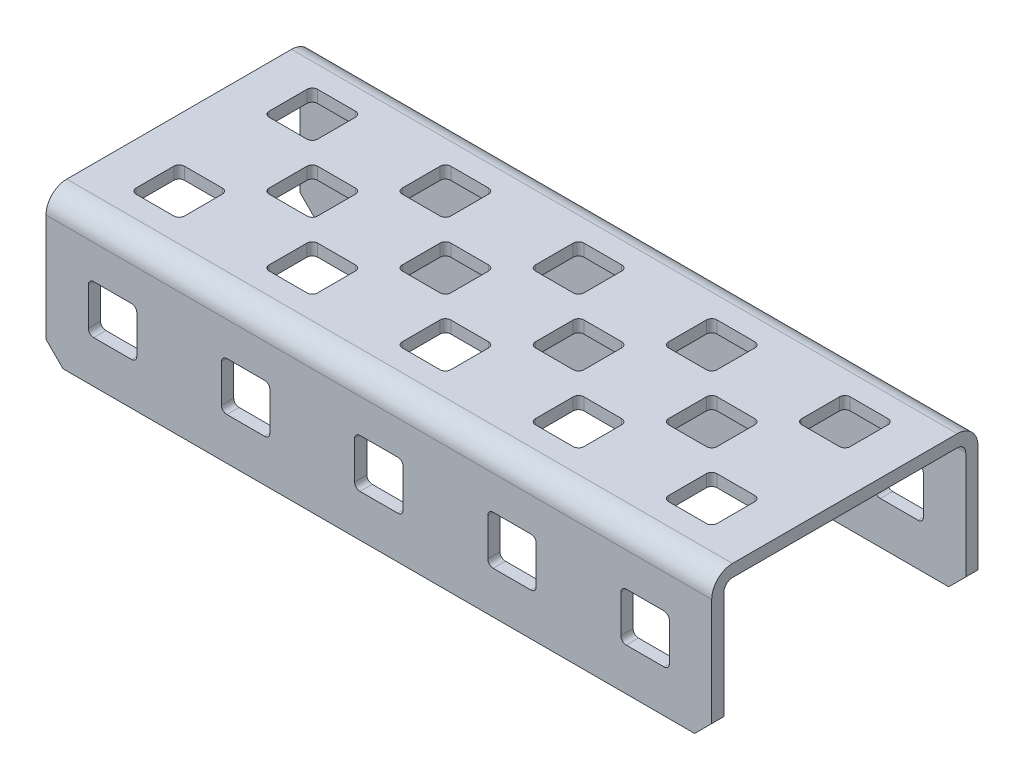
from build123d import *

# Parameters (mm, degrees)
SKETCH1_W           = 63.5
SKETCH1_H           = 25.4
BOSS_EXTRUDE1_DEPTH = 13.8684
SKETCH2_W           = 23.0632
SKETCH2_H           = 12.7
CUT_EXTRUDE1_DEPTH  = 67.610188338
SKETCH3_W           = 4.6228
SKETCH3_H           = 4.6228
CUT_EXTRUDE2_DEPTH  = 43.145487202
SKETCH4_W           = 4.6228
SKETCH4_H           = 4.6228
CUT_EXTRUDE3_DEPTH  = 43.145487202
SKETCH5_W           = 4.6228
SKETCH5_H           = 4.6228
CUT_EXTRUDE4_DEPTH  = 43.145487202
SKETCH6_W           = 4.6228
SKETCH6_H           = 4.6228
CUT_EXTRUDE5_DEPTH  = 43.145487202
SKETCH7_W           = 4.6228
SKETCH7_H           = 4.6228
CUT_EXTRUDE6_DEPTH  = 43.145487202
SKETCH8_W           = 4.6228
SKETCH8_H           = 4.6228
CUT_EXTRUDE7_DEPTH  = 43.145487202
SKETCH9_W           = 4.6228
SKETCH9_H           = 4.6228
CUT_EXTRUDE8_DEPTH  = 43.145487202
SKETCH10_W          = 4.6228
SKETCH10_H          = 4.6228
CUT_EXTRUDE9_DEPTH  = 43.145487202
SKETCH11_W          = 4.6228
SKETCH11_H          = 4.6228
CUT_EXTRUDE10_DEPTH = 43.145487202
SKETCH12_W          = 4.6228
SKETCH12_H          = 4.6228
CUT_EXTRUDE11_DEPTH = 43.145487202
SKETCH13_W          = 4.6228
SKETCH13_H          = 4.6228
CUT_EXTRUDE12_DEPTH = 43.145487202
SKETCH14_W          = 4.6228
SKETCH14_H          = 4.6228
CUT_EXTRUDE13_DEPTH = 43.145487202
SKETCH15_W          = 4.6228
SKETCH15_H          = 4.6228
CUT_EXTRUDE14_DEPTH = 43.145487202
CUT_EXTRUDE15_REACH = 48.669
SKETCH16_W          = 4.6228
SKETCH16_H          = 4.6228
CUT_EXTRUDE16_REACH = 48.669
SKETCH17_W          = 4.6228
SKETCH17_H          = 4.6228
CUT_EXTRUDE17_REACH = 48.669
SKETCH18_W          = 4.6228
SKETCH18_H          = 4.6228
CUT_EXTRUDE18_REACH = 48.669
SKETCH19_W          = 4.6228
SKETCH19_H          = 4.6228
CUT_EXTRUDE19_REACH = 48.669
SKETCH20_W          = 4.6228
SKETCH20_H          = 4.6228
SKETCH21_W          = 4.6228
SKETCH21_H          = 4.6228
CUT_EXTRUDE20_DEPTH = 47.669314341
SKETCH22_W          = 4.6228
SKETCH22_H          = 4.6228
CUT_EXTRUDE21_DEPTH = 47.669314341
SKETCH23_W          = 4.6228
SKETCH23_H          = 4.6228
CUT_EXTRUDE22_DEPTH = 47.669314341
SKETCH24_W          = 4.6228
SKETCH24_H          = 4.6228
CUT_EXTRUDE23_DEPTH = 47.669314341
SKETCH25_W          = 4.6228
SKETCH25_H          = 4.6228
CUT_EXTRUDE24_DEPTH = 47.669314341
SKETCH26_W          = 4.6228
SKETCH26_H          = 4.6228
CUT_EXTRUDE25_DEPTH = 43.51217014
CHAMFER1_SIZE       = 1.6256
FILLET1_R           = 0.508
FILLET2_R           = 0.812800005
FILLET3_R           = 1.981200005


with BuildPart() as part:
    # Sketch1 → Boss-Extrude1 (new body)
    with BuildSketch(Plane.XZ.offset(12.7)):
        with Locations((5.284779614, -2.900550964)):
            Rectangle(SKETCH1_W, SKETCH1_H)
    extrude(amount=-BOSS_EXTRUDE1_DEPTH)

    # Sketch2 → Cut-Extrude1 (cut, through all)
    with BuildSketch(Plane(origin=(37.034779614, 0, 0), x_dir=(0, 0, -1), z_dir=(1, 0, 0))):
        with Locations((2.900550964, -6.35)):
            Rectangle(SKETCH2_W, SKETCH2_H)
    extrude(amount=-CUT_EXTRUDE1_DEPTH, mode=Mode.SUBTRACT)

    # Sketch3 → Cut-Extrude2 (cut, through all)
    with BuildSketch(Plane.XZ):
        with Locations((24.334779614, -2.900550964)):
            Rectangle(SKETCH3_W, SKETCH3_H)
    extrude(amount=-CUT_EXTRUDE2_DEPTH, mode=Mode.SUBTRACT)

    # Sketch4 → Cut-Extrude3 (cut, through all)
    with BuildSketch(Plane.XZ):
        with Locations((11.634779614, -2.900550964)):
            Rectangle(SKETCH4_W, SKETCH4_H)
    extrude(amount=-CUT_EXTRUDE3_DEPTH, mode=Mode.SUBTRACT)

    # Sketch5 → Cut-Extrude4 (cut, through all)
    with BuildSketch(Plane.XZ):
        with Locations((-20.115220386, -9.250550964)):
            Rectangle(SKETCH5_W, SKETCH5_H)
    extrude(amount=-CUT_EXTRUDE4_DEPTH, mode=Mode.SUBTRACT)

    # Sketch6 → Cut-Extrude5 (cut, through all)
    with BuildSketch(Plane.XZ):
        with Locations((-20.115220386, 3.449449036)):
            Rectangle(SKETCH6_W, SKETCH6_H)
    extrude(amount=-CUT_EXTRUDE5_DEPTH, mode=Mode.SUBTRACT)

    # Sketch7 → Cut-Extrude6 (cut, through all)
    with BuildSketch(Plane.XZ):
        with Locations((-13.765220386, -2.900550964)):
            Rectangle(SKETCH7_W, SKETCH7_H)
    extrude(amount=-CUT_EXTRUDE6_DEPTH, mode=Mode.SUBTRACT)

    # Sketch8 → Cut-Extrude7 (cut, through all)
    with BuildSketch(Plane.XZ):
        with Locations((-7.415220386, -9.250550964)):
            Rectangle(SKETCH8_W, SKETCH8_H)
    extrude(amount=-CUT_EXTRUDE7_DEPTH, mode=Mode.SUBTRACT)

    # Sketch9 → Cut-Extrude8 (cut, through all)
    with BuildSketch(Plane.XZ):
        with Locations((-7.415220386, 3.449449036)):
            Rectangle(SKETCH9_W, SKETCH9_H)
    extrude(amount=-CUT_EXTRUDE8_DEPTH, mode=Mode.SUBTRACT)

    # Sketch10 → Cut-Extrude9 (cut, through all)
    with BuildSketch(Plane.XZ):
        with Locations((5.284779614, -9.250550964)):
            Rectangle(SKETCH10_W, SKETCH10_H)
    extrude(amount=-CUT_EXTRUDE9_DEPTH, mode=Mode.SUBTRACT)

    # Sketch11 → Cut-Extrude10 (cut, through all)
    with BuildSketch(Plane.XZ):
        with Locations((5.284779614, 3.449449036)):
            Rectangle(SKETCH11_W, SKETCH11_H)
    extrude(amount=-CUT_EXTRUDE10_DEPTH, mode=Mode.SUBTRACT)

    # Sketch12 → Cut-Extrude11 (cut, through all)
    with BuildSketch(Plane.XZ):
        with Locations((17.984779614, -9.250550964)):
            Rectangle(SKETCH12_W, SKETCH12_H)
    extrude(amount=-CUT_EXTRUDE11_DEPTH, mode=Mode.SUBTRACT)

    # Sketch13 → Cut-Extrude12 (cut, through all)
    with BuildSketch(Plane.XZ):
        with Locations((17.984779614, 3.449449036)):
            Rectangle(SKETCH13_W, SKETCH13_H)
    extrude(amount=-CUT_EXTRUDE12_DEPTH, mode=Mode.SUBTRACT)

    # Sketch14 → Cut-Extrude13 (cut, through all)
    with BuildSketch(Plane.XZ):
        with Locations((30.684779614, -9.250550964)):
            Rectangle(SKETCH14_W, SKETCH14_H)
    extrude(amount=-CUT_EXTRUDE13_DEPTH, mode=Mode.SUBTRACT)

    # Sketch15 → Cut-Extrude14 (cut, through all)
    with BuildSketch(Plane.XZ):
        with Locations((30.684779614, 3.449449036)):
            Rectangle(SKETCH15_W, SKETCH15_H)
    extrude(amount=-CUT_EXTRUDE14_DEPTH, mode=Mode.SUBTRACT)

    # Sketch16 → Cut-Extrude15 (cut, up to next)
    with BuildSketch(Plane.XY.offset(9.799449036), mode=Mode.PRIVATE) as cut_extrude15_sk1:
        with Locations((-20.115220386, -6.35)):
            Rectangle(SKETCH16_W, SKETCH16_H)
    cut_extrude15_tool1 = extrude(cut_extrude15_sk1.sketch, amount=-CUT_EXTRUDE15_REACH, mode=Mode.PRIVATE) & part.part
    add(cut_extrude15_tool1.solids().sort_by_distance((-20.11522, -6.35, 9.799449))[0], mode=Mode.SUBTRACT)

    # Sketch17 → Cut-Extrude16 (cut, up to next)
    with BuildSketch(Plane.XY.offset(9.799449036), mode=Mode.PRIVATE) as cut_extrude16_sk1:
        with Locations((-7.415220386, -6.35)):
            Rectangle(SKETCH17_W, SKETCH17_H)
    cut_extrude16_tool1 = extrude(cut_extrude16_sk1.sketch, amount=-CUT_EXTRUDE16_REACH, mode=Mode.PRIVATE) & part.part
    add(cut_extrude16_tool1.solids().sort_by_distance((-7.41522, -6.35, 9.799449))[0], mode=Mode.SUBTRACT)

    # Sketch18 → Cut-Extrude17 (cut, up to next)
    with BuildSketch(Plane.XY.offset(9.799449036), mode=Mode.PRIVATE) as cut_extrude17_sk1:
        with Locations((5.284779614, -6.35)):
            Rectangle(SKETCH18_W, SKETCH18_H)
    cut_extrude17_tool1 = extrude(cut_extrude17_sk1.sketch, amount=-CUT_EXTRUDE17_REACH, mode=Mode.PRIVATE) & part.part
    add(cut_extrude17_tool1.solids().sort_by_distance((5.28478, -6.35, 9.799449))[0], mode=Mode.SUBTRACT)

    # Sketch19 → Cut-Extrude18 (cut, up to next)
    with BuildSketch(Plane.XY.offset(9.799449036), mode=Mode.PRIVATE) as cut_extrude18_sk1:
        with Locations((17.984779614, -6.35)):
            Rectangle(SKETCH19_W, SKETCH19_H)
    cut_extrude18_tool1 = extrude(cut_extrude18_sk1.sketch, amount=-CUT_EXTRUDE18_REACH, mode=Mode.PRIVATE) & part.part
    add(cut_extrude18_tool1.solids().sort_by_distance((17.98478, -6.35, 9.799449))[0], mode=Mode.SUBTRACT)

    # Sketch20 → Cut-Extrude19 (cut, up to next)
    with BuildSketch(Plane.XY.offset(9.799449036), mode=Mode.PRIVATE) as cut_extrude19_sk1:
        with Locations((30.684779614, -6.35)):
            Rectangle(SKETCH20_W, SKETCH20_H)
    cut_extrude19_tool1 = extrude(cut_extrude19_sk1.sketch, amount=-CUT_EXTRUDE19_REACH, mode=Mode.PRIVATE) & part.part
    add(cut_extrude19_tool1.solids().sort_by_distance((30.68478, -6.35, 9.799449))[0], mode=Mode.SUBTRACT)

    # Sketch21 → Cut-Extrude20 (cut, through all)
    with BuildSketch(Plane(origin=(0, 0, -15.600550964), x_dir=(-1, 0, 0), z_dir=(0, 0, -1))):
        with Locations((20.115220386, -6.35)):
            Rectangle(SKETCH21_W, SKETCH21_H)
    extrude(amount=-CUT_EXTRUDE20_DEPTH, mode=Mode.SUBTRACT)

    # Sketch22 → Cut-Extrude21 (cut, through all)
    with BuildSketch(Plane(origin=(0, 0, -15.600550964), x_dir=(-1, 0, 0), z_dir=(0, 0, -1))):
        with Locations((7.415220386, -6.35)):
            Rectangle(SKETCH22_W, SKETCH22_H)
    extrude(amount=-CUT_EXTRUDE21_DEPTH, mode=Mode.SUBTRACT)

    # Sketch23 → Cut-Extrude22 (cut, through all)
    with BuildSketch(Plane(origin=(0, 0, -15.600550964), x_dir=(-1, 0, 0), z_dir=(0, 0, -1))):
        with Locations((-5.284779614, -6.35)):
            Rectangle(SKETCH23_W, SKETCH23_H)
    extrude(amount=-CUT_EXTRUDE22_DEPTH, mode=Mode.SUBTRACT)

    # Sketch24 → Cut-Extrude23 (cut, through all)
    with BuildSketch(Plane(origin=(0, 0, -15.600550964), x_dir=(-1, 0, 0), z_dir=(0, 0, -1))):
        with Locations((-17.984779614, -6.35)):
            Rectangle(SKETCH24_W, SKETCH24_H)
    extrude(amount=-CUT_EXTRUDE23_DEPTH, mode=Mode.SUBTRACT)

    # Sketch25 → Cut-Extrude24 (cut, through all)
    with BuildSketch(Plane(origin=(0, 0, -15.600550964), x_dir=(-1, 0, 0), z_dir=(0, 0, -1))):
        with Locations((-30.684779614, -6.35)):
            Rectangle(SKETCH25_W, SKETCH25_H)
    extrude(amount=-CUT_EXTRUDE24_DEPTH, mode=Mode.SUBTRACT)

    # Sketch26 → Cut-Extrude25 (cut, through all)
    with BuildSketch(Plane(origin=(0, 1.1684, 0), x_dir=(-1, 0, 0), z_dir=(0, 1, 0))):
        with Locations((1.065220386, -2.900550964)):
            Rectangle(SKETCH26_W, SKETCH26_H)
    extrude(amount=-CUT_EXTRUDE25_DEPTH, mode=Mode.SUBTRACT)

    # Chamfer1
    chamfer1_edges = [part.edges().sort_by_distance(p)[0] for p in [
        (-26.465220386, -12.7, -15.016350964),
        (37.034779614, -12.7, 9.215249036),
        (37.034779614, -12.7, -15.016350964),
        (-26.465220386, -12.7, 9.215249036),
    ]]
    chamfer(chamfer1_edges, length=CHAMFER1_SIZE)

    # Fillet1
    fillet1_edges = [part.edges().sort_by_distance(p)[0] for p in [
        (-5.103820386, 0.5842, -6.939150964),
        (-5.103820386, 0.5842, -11.561950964),
        (-9.726620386, 0.5842, -11.561950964),
        (-9.726620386, 0.5842, -6.939150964),
        (-5.103820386, 0.5842, 5.760849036),
        (-5.103820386, 0.5842, 1.138049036),
        (-9.726620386, 0.5842, 1.138049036),
        (-9.726620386, 0.5842, 5.760849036),
        (7.596179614, 0.5842, -6.939150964),
        (7.596179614, 0.5842, -11.561950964),
        (2.973379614, 0.5842, -11.561950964),
        (2.973379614, 0.5842, -6.939150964),
        (7.596179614, 0.5842, 5.760849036),
        (7.596179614, 0.5842, 1.138049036),
        (2.973379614, 0.5842, 1.138049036),
        (2.973379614, 0.5842, 5.760849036),
        (20.296179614, 0.5842, -6.939150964),
        (20.296179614, 0.5842, -11.561950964),
        (15.673379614, 0.5842, -11.561950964),
        (15.673379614, 0.5842, -6.939150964),
        (20.296179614, 0.5842, 5.760849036),
        (20.296179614, 0.5842, 1.138049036),
        (15.673379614, 0.5842, 1.138049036),
        (15.673379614, 0.5842, 5.760849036),
        (32.996179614, 0.5842, -6.939150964),
        (32.996179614, 0.5842, -11.561950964),
        (28.373379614, 0.5842, -11.561950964),
        (28.373379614, 0.5842, -6.939150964),
        (32.996179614, 0.5842, 5.760849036),
        (32.996179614, 0.5842, 1.138049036),
        (28.373379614, 0.5842, 1.138049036),
        (28.373379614, 0.5842, 5.760849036),
        (-17.803820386, -8.6614, 9.215249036),
        (-22.426620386, -8.6614, 9.215249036),
        (-22.426620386, -4.0386, 9.215249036),
        (-17.803820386, -4.0386, 9.215249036),
        (-5.103820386, -8.6614, 9.215249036),
        (-9.726620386, -8.6614, 9.215249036),
        (-9.726620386, -4.0386, 9.215249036),
        (-5.103820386, -4.0386, 9.215249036),
        (7.596179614, -8.6614, 9.215249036),
        (2.973379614, -8.6614, 9.215249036),
        (2.973379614, -4.0386, 9.215249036),
        (7.596179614, -4.0386, 9.215249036),
        (20.296179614, -8.6614, 9.215249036),
        (15.673379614, -8.6614, 9.215249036),
        (15.673379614, -4.0386, 9.215249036),
        (20.296179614, -4.0386, 9.215249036),
        (32.996179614, -8.6614, 9.215249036),
        (28.373379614, -8.6614, 9.215249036),
        (28.373379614, -4.0386, 9.215249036),
        (32.996179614, -4.0386, 9.215249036),
        (-17.803820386, -8.6614, -15.016350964),
        (-22.426620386, -4.0386, -15.016350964),
        (-17.803820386, -4.0386, -15.016350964),
        (-22.426620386, -8.6614, -15.016350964),
        (22.023379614, 0.5842, -5.211950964),
        (22.023379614, 0.5842, -0.589150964),
        (26.646179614, 0.5842, -0.589150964),
        (26.646179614, 0.5842, -5.211950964),
        (-5.103820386, -8.6614, -15.016350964),
        (-9.726620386, -4.0386, -15.016350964),
        (-5.103820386, -4.0386, -15.016350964),
        (-9.726620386, -8.6614, -15.016350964),
        (7.596179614, -8.6614, -15.016350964),
        (2.973379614, -4.0386, -15.016350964),
        (7.596179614, -4.0386, -15.016350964),
        (2.973379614, -8.6614, -15.016350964),
        (20.296179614, -8.6614, -15.016350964),
        (15.673379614, -4.0386, -15.016350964),
        (20.296179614, -4.0386, -15.016350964),
        (15.673379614, -8.6614, -15.016350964),
        (32.996179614, -8.6614, -15.016350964),
        (28.373379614, -4.0386, -15.016350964),
        (32.996179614, -4.0386, -15.016350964),
        (28.373379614, -8.6614, -15.016350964),
        (1.246179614, 0.5842, -0.589150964),
        (-3.376620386, 0.5842, -0.589150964),
        (-3.376620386, 0.5842, -5.211950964),
        (1.246179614, 0.5842, -5.211950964),
        (9.323379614, 0.5842, -5.211950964),
        (9.323379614, 0.5842, -0.589150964),
        (13.946179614, 0.5842, -0.589150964),
        (13.946179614, 0.5842, -5.211950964),
        (-17.803820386, 0.5842, -6.939150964),
        (-17.803820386, 0.5842, -11.561950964),
        (-22.426620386, 0.5842, -11.561950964),
        (-22.426620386, 0.5842, -6.939150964),
        (-17.803820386, 0.5842, 5.760849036),
        (-17.803820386, 0.5842, 1.138049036),
        (-22.426620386, 0.5842, 1.138049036),
        (-22.426620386, 0.5842, 5.760849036),
        (-11.453820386, 0.5842, -0.589150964),
        (-11.453820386, 0.5842, -5.211950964),
        (-16.076620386, 0.5842, -5.211950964),
        (-16.076620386, 0.5842, -0.589150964),
    ]]
    fillet(fillet1_edges, radius=FILLET1_R)

    # Fillet2
    fillet2_edges = [part.edges().sort_by_distance(p)[0] for p in [
        (5.284779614, 0, 8.631049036),
        (5.284779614, 0, -14.432150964),
    ]]
    fillet(fillet2_edges, radius=FILLET2_R)

    # Fillet3
    fillet3_edges = [part.edges().sort_by_distance(p)[0] for p in [
        (5.284779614, 1.1684, 9.799449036),
        (5.284779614, 1.1684, -15.600550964),
    ]]
    fillet(fillet3_edges, radius=FILLET3_R)


solid = part.part
